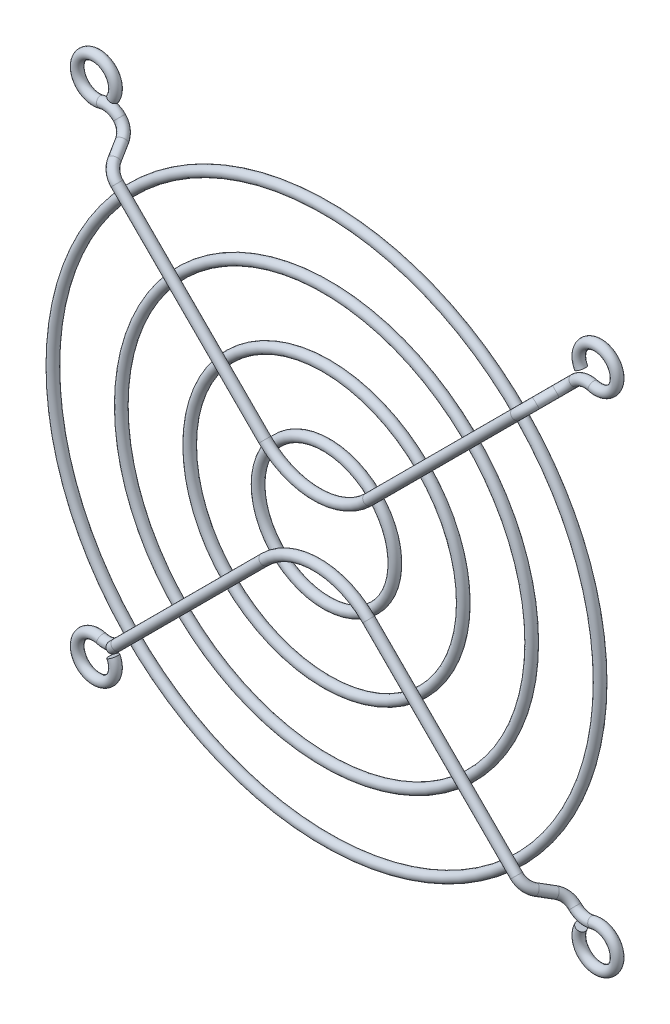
ISO-10303-21;
HEADER;
FILE_DESCRIPTION(('STEP AP214'),'2;1');
FILE_NAME('part.step','',(''),(''),'','','');
FILE_SCHEMA(('AUTOMOTIVE_DESIGN { 1 0 10303 214 1 1 1 1 }'));
ENDSEC;
DATA;
#1=APPLICATION_CONTEXT('core data for automotive mechanical design processes');
#2=APPLICATION_PROTOCOL_DEFINITION('international standard','automotive_design',2000,#1);
#3=PRODUCT_CONTEXT('',#1,'mechanical');
#4=PRODUCT('Part','Part','',(#3));
#5=PRODUCT_RELATED_PRODUCT_CATEGORY('part','',(#4));
#6=PRODUCT_DEFINITION_FORMATION('','',#4);
#7=PRODUCT_DEFINITION_CONTEXT('part definition',#1,'design');
#8=PRODUCT_DEFINITION('design','',#6,#7);
#9=PRODUCT_DEFINITION_SHAPE('','',#8);
#10=(LENGTH_UNIT() NAMED_UNIT(*) SI_UNIT(.MILLI.,.METRE.));
#11=(NAMED_UNIT(*) PLANE_ANGLE_UNIT() SI_UNIT($,.RADIAN.));
#12=(NAMED_UNIT(*) SI_UNIT($,.STERADIAN.) SOLID_ANGLE_UNIT());
#13=UNCERTAINTY_MEASURE_WITH_UNIT(LENGTH_MEASURE(1.E-05),#10,'distance_accuracy_value','');
#14=(GEOMETRIC_REPRESENTATION_CONTEXT(3) GLOBAL_UNCERTAINTY_ASSIGNED_CONTEXT((#13)) GLOBAL_UNIT_ASSIGNED_CONTEXT((#10,
#11,#12)) REPRESENTATION_CONTEXT('',''));
#15=CARTESIAN_POINT('',(0.,0.,0.));
#16=DIRECTION('',(0.,0.,1.));
#17=DIRECTION('',(1.,0.,0.));
#18=AXIS2_PLACEMENT_3D('',#15,#16,#17);
#19=CARTESIAN_POINT('',(0.,0.,3.4));
#20=DIRECTION('',(0.,0.,-1.));
#21=DIRECTION('',(-1.,0.,0.));
#22=AXIS2_PLACEMENT_3D('',#19,#20,#21);
#23=TOROIDAL_SURFACE('',#22,11.25,0.800000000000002);
#24=CARTESIAN_POINT('',(-12.05,0.,3.4));
#25=VERTEX_POINT('',#24);
#26=VERTEX_LOOP('',#25);
#27=FACE_BOUND('',#26,.T.);
#28=ADVANCED_FACE('F37',(#27),#23,.T.);
#29=CLOSED_SHELL('',(#28));
#30=MANIFOLD_SOLID_BREP('B2',#29);
#31=CARTESIAN_POINT('',(0.,0.,3.4));
#32=DIRECTION('',(0.,0.,-1.));
#33=DIRECTION('',(-1.,0.,0.));
#34=AXIS2_PLACEMENT_3D('',#31,#32,#33);
#35=TOROIDAL_SURFACE('',#34,33.75,0.800000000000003);
#36=CARTESIAN_POINT('',(-34.55,0.,3.4));
#37=VERTEX_POINT('',#36);
#38=VERTEX_LOOP('',#37);
#39=FACE_BOUND('',#38,.T.);
#40=ADVANCED_FACE('F55',(#39),#35,.T.);
#41=CLOSED_SHELL('',(#40));
#42=MANIFOLD_SOLID_BREP('B6',#41);
#43=CARTESIAN_POINT('',(0.,0.,3.4));
#44=DIRECTION('',(0.,0.,-1.));
#45=DIRECTION('',(-1.,0.,0.));
#46=AXIS2_PLACEMENT_3D('',#43,#44,#45);
#47=TOROIDAL_SURFACE('',#46,22.5,0.800000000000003);
#48=CARTESIAN_POINT('',(-23.3,0.,3.4));
#49=VERTEX_POINT('',#48);
#50=VERTEX_LOOP('',#49);
#51=FACE_BOUND('',#50,.T.);
#52=ADVANCED_FACE('F73',(#51),#47,.T.);
#53=CLOSED_SHELL('',(#52));
#54=MANIFOLD_SOLID_BREP('B33',#53);
#55=CARTESIAN_POINT('',(0.,0.,3.4));
#56=DIRECTION('',(0.,0.,-1.));
#57=DIRECTION('',(-1.,0.,0.));
#58=AXIS2_PLACEMENT_3D('',#55,#56,#57);
#59=TOROIDAL_SURFACE('',#58,45.,0.800000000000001);
#60=CARTESIAN_POINT('',(-45.8,0.,3.4));
#61=VERTEX_POINT('',#60);
#62=VERTEX_LOOP('',#61);
#63=FACE_BOUND('',#62,.T.);
#64=ADVANCED_FACE('F93',(#63),#59,.T.);
#65=CLOSED_SHELL('',(#64));
#66=MANIFOLD_SOLID_BREP('B51',#65);
#67=CARTESIAN_POINT('',(-41.2499999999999,-41.25,0.));
#68=DIRECTION('',(0.,0.,-1.));
#69=DIRECTION('',(-1.,0.,0.));
#70=AXIS2_PLACEMENT_3D('',#67,#68,#69);
#71=TOROIDAL_SURFACE('',#70,3.14999999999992,0.8);
#72=CARTESIAN_POINT('',(-38.4791267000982,-39.7517472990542,0.));
#73=DIRECTION('',(-0.475635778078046,0.879642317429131,0.));
#74=DIRECTION('',(0.,0.,-1.));
#75=AXIS2_PLACEMENT_3D('',#72,#73,#74);
#76=CIRCLE('',#75,0.8);
#77=CARTESIAN_POINT('',(-37.7754128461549,-39.3712386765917,0.));
#78=VERTEX_POINT('',#77);
#79=EDGE_CURVE('E92',#78,#78,#76,.T.);
#80=CARTESIAN_POINT('',(-40.392127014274,-38.2190671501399,0.));
#81=DIRECTION('',(-0.962200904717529,0.272340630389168,0.));
#82=DIRECTION('',(0.,0.,-1.));
#83=AXIS2_PLACEMENT_3D('',#80,#81,#82);
#84=CIRCLE('',#83,0.8);
#85=CARTESIAN_POINT('',(-40.1742545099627,-37.4493064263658,0.));
#86=VERTEX_POINT('',#85);
#87=EDGE_CURVE('E118',#86,#86,#84,.T.);
#88=CARTESIAN_POINT('',(-41.2499999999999,-41.25,0.));
#89=DIRECTION('',(0.,0.,-1.));
#90=DIRECTION('',(-1.,0.,0.));
#91=AXIS2_PLACEMENT_3D('',#88,#89,#90);
#92=CIRCLE('',#91,3.94999999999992);
#93=EDGE_CURVE('',#78,#86,#92,.T.);
#94=ORIENTED_EDGE('',*,*,#79,.F.);
#95=ORIENTED_EDGE('',*,*,#87,.T.);
#96=ORIENTED_EDGE('',*,*,#93,.T.);
#97=ORIENTED_EDGE('',*,*,#93,.F.);
#98=EDGE_LOOP('',(#94,#96,#95,#97));
#99=FACE_BOUND('',#98,.T.);
#100=ADVANCED_FACE('F112',(#99),#71,.T.);
#101=CARTESIAN_POINT('',(-39.5751051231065,-35.3324644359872,0.));
#102=DIRECTION('',(0.,0.,1.));
#103=DIRECTION('',(1.,0.,0.));
#104=AXIS2_PLACEMENT_3D('',#101,#102,#103);
#105=TOROIDAL_SURFACE('',#104,3.00000000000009,0.8);
#106=CARTESIAN_POINT('',(-37.4537847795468,-37.4537847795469,0.));
#107=DIRECTION('',(-0.707106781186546,-0.707106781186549,0.));
#108=DIRECTION('',(0.,0.,-1.));
#109=AXIS2_PLACEMENT_3D('',#106,#107,#108);
#110=CIRCLE('',#109,0.8);
#111=CARTESIAN_POINT('',(-37.4537847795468,-37.4537847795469,-0.800000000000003));
#112=VERTEX_POINT('',#111);
#113=EDGE_CURVE('E122',#112,#112,#110,.T.);
#114=ORIENTED_EDGE('',*,*,#113,.T.);
#115=EDGE_LOOP('',(#114));
#116=FACE_BOUND('',#115,.T.);
#117=ORIENTED_EDGE('',*,*,#87,.F.);
#118=EDGE_LOOP('',(#117));
#119=FACE_BOUND('',#118,.T.);
#120=ADVANCED_FACE('F207',(#116,#119),#105,.T.);
#121=CARTESIAN_POINT('',(-37.4537847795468,-37.4537847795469,3.));
#122=DIRECTION('',(0.707106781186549,-0.707106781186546,0.));
#123=DIRECTION('',(-0.707106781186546,-0.707106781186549,0.));
#124=AXIS2_PLACEMENT_3D('',#121,#122,#123);
#125=TOROIDAL_SURFACE('',#124,3.,0.8);
#126=CARTESIAN_POINT('',(-35.6722390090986,-35.6722390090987,1.37144563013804));
#127=DIRECTION('',(-0.383853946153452,-0.383853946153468,-0.839828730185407));
#128=DIRECTION('',(0.593848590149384,0.593848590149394,-0.542851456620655));
#129=AXIS2_PLACEMENT_3D('',#126,#127,#128);
#130=CIRCLE('',#129,0.8);
#131=CARTESIAN_POINT('',(-35.1971601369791,-35.1971601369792,0.937164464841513));
#132=VERTEX_POINT('',#131);
#133=EDGE_CURVE('E126',#132,#132,#130,.T.);
#134=CARTESIAN_POINT('',(-37.4537847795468,-37.4537847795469,3.));
#135=DIRECTION('',(0.707106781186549,-0.707106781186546,0.));
#136=DIRECTION('',(-0.707106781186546,-0.707106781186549,0.));
#137=AXIS2_PLACEMENT_3D('',#134,#135,#136);
#138=CIRCLE('',#137,3.8);
#139=EDGE_CURVE('',#112,#132,#138,.T.);
#140=ORIENTED_EDGE('',*,*,#113,.F.);
#141=ORIENTED_EDGE('',*,*,#133,.T.);
#142=ORIENTED_EDGE('',*,*,#139,.T.);
#143=ORIENTED_EDGE('',*,*,#139,.F.);
#144=EDGE_LOOP('',(#140,#142,#141,#143));
#145=FACE_BOUND('',#144,.T.);
#146=ADVANCED_FACE('F211',(#145),#125,.T.);
#147=CARTESIAN_POINT('',(-34.6405999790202,-34.6405999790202,3.62855436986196));
#148=DIRECTION('',(-0.383853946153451,-0.383853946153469,-0.839828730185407));
#149=DIRECTION('',(0.,-0.909502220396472,0.415699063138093));
#150=AXIS2_PLACEMENT_3D('',#147,#148,#149);
#151=CYLINDRICAL_SURFACE('',#150,0.8);
#152=CARTESIAN_POINT('',(-34.6405999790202,-34.6405999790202,3.62855436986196));
#153=DIRECTION('',(-0.383853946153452,-0.383853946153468,-0.839828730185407));
#154=DIRECTION('',(0.593848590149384,0.593848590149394,-0.542851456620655));
#155=AXIS2_PLACEMENT_3D('',#152,#153,#154);
#156=CIRCLE('',#155,0.8);
#157=CARTESIAN_POINT('',(-35.1156788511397,-35.1156788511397,4.06283553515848));
#158=VERTEX_POINT('',#157);
#159=EDGE_CURVE('E131',#158,#158,#156,.T.);
#160=ORIENTED_EDGE('',*,*,#159,.T.);
#161=EDGE_LOOP('',(#160));
#162=FACE_BOUND('',#161,.T.);
#163=ORIENTED_EDGE('',*,*,#133,.F.);
#164=EDGE_LOOP('',(#163));
#165=FACE_BOUND('',#164,.T.);
#166=ADVANCED_FACE('F217',(#162,#165),#151,.T.);
#167=CARTESIAN_POINT('',(-32.859054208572,-32.8590542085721,2.));
#168=DIRECTION('',(-0.707106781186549,0.707106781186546,0.));
#169=DIRECTION('',(0.707106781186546,0.707106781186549,0.));
#170=AXIS2_PLACEMENT_3D('',#167,#168,#169);
#171=TOROIDAL_SURFACE('',#170,3.,0.8);
#172=CARTESIAN_POINT('',(-32.859054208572,-32.8590542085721,5.));
#173=DIRECTION('',(-0.707106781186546,-0.707106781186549,0.));
#174=DIRECTION('',(0.,0.,-1.));
#175=AXIS2_PLACEMENT_3D('',#172,#173,#174);
#176=CIRCLE('',#175,0.8);
#177=CARTESIAN_POINT('',(-32.859054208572,-32.859054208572,5.8));
#178=VERTEX_POINT('',#177);
#179=EDGE_CURVE('E134',#178,#178,#176,.T.);
#180=CARTESIAN_POINT('',(-32.859054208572,-32.8590542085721,2.));
#181=DIRECTION('',(-0.707106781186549,0.707106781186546,0.));
#182=DIRECTION('',(0.707106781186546,0.707106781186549,0.));
#183=AXIS2_PLACEMENT_3D('',#180,#181,#182);
#184=CIRCLE('',#183,3.8);
#185=EDGE_CURVE('',#158,#178,#184,.T.);
#186=ORIENTED_EDGE('',*,*,#159,.F.);
#187=ORIENTED_EDGE('',*,*,#179,.T.);
#188=ORIENTED_EDGE('',*,*,#185,.T.);
#189=ORIENTED_EDGE('',*,*,#185,.F.);
#190=EDGE_LOOP('',(#186,#188,#187,#189));
#191=FACE_BOUND('',#190,.T.);
#192=ADVANCED_FACE('F224',(#191),#171,.T.);
#193=CARTESIAN_POINT('',(-8.5355339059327,-8.53553390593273,5.));
#194=DIRECTION('',(-0.707106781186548,-0.707106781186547,0.));
#195=DIRECTION('',(-0.707106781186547,0.707106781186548,0.));
#196=AXIS2_PLACEMENT_3D('',#193,#194,#195);
#197=CYLINDRICAL_SURFACE('',#196,0.8);
#198=CARTESIAN_POINT('',(-8.5355339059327,-8.53553390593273,5.));
#199=DIRECTION('',(-0.707106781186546,-0.707106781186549,0.));
#200=DIRECTION('',(0.,0.,-1.));
#201=AXIS2_PLACEMENT_3D('',#198,#199,#200);
#202=CIRCLE('',#201,0.8);
#203=CARTESIAN_POINT('',(-9.10121933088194,-7.96984848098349,5.));
#204=VERTEX_POINT('',#203);
#205=EDGE_CURVE('E137',#204,#204,#202,.T.);
#206=ORIENTED_EDGE('',*,*,#205,.T.);
#207=EDGE_LOOP('',(#206));
#208=FACE_BOUND('',#207,.T.);
#209=ORIENTED_EDGE('',*,*,#179,.F.);
#210=EDGE_LOOP('',(#209));
#211=FACE_BOUND('',#210,.T.);
#212=ADVANCED_FACE('F228',(#208,#211),#197,.T.);
#213=CARTESIAN_POINT('',(0.,-17.0710678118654,5.));
#214=DIRECTION('',(0.,0.,1.));
#215=DIRECTION('',(1.,0.,0.));
#216=AXIS2_PLACEMENT_3D('',#213,#214,#215);
#217=TOROIDAL_SURFACE('',#216,12.0710678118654,0.8);
#218=CARTESIAN_POINT('',(8.5355339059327,-8.53553390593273,5.));
#219=DIRECTION('',(-0.707106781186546,0.707106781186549,0.));
#220=DIRECTION('',(0.,0.,-1.));
#221=AXIS2_PLACEMENT_3D('',#218,#219,#220);
#222=CIRCLE('',#221,0.8);
#223=CARTESIAN_POINT('',(9.10121933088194,-7.96984848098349,5.));
#224=VERTEX_POINT('',#223);
#225=EDGE_CURVE('E158',#224,#224,#222,.T.);
#226=CARTESIAN_POINT('',(0.,-17.0710678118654,5.));
#227=DIRECTION('',(0.,0.,1.));
#228=DIRECTION('',(1.,0.,0.));
#229=AXIS2_PLACEMENT_3D('',#226,#227,#228);
#230=CIRCLE('',#229,12.8710678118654);
#231=EDGE_CURVE('',#224,#204,#230,.T.);
#232=ORIENTED_EDGE('',*,*,#225,.T.);
#233=ORIENTED_EDGE('',*,*,#205,.F.);
#234=ORIENTED_EDGE('',*,*,#231,.T.);
#235=ORIENTED_EDGE('',*,*,#231,.F.);
#236=EDGE_LOOP('',(#232,#234,#233,#235));
#237=FACE_BOUND('',#236,.T.);
#238=ADVANCED_FACE('F162',(#237),#217,.T.);
#239=CARTESIAN_POINT('',(-38.4791267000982,-39.7517472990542,0.));
#240=DIRECTION('',(0.475635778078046,-0.879642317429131,0.));
#241=DIRECTION('',(0.,0.,-1.));
#242=AXIS2_PLACEMENT_3D('',#239,#240,#241);
#243=PLANE('',#242);
#244=ORIENTED_EDGE('',*,*,#79,.T.);
#245=EDGE_LOOP('',(#244));
#246=FACE_BOUND('',#245,.T.);
#247=ADVANCED_FACE('F198',(#246),#243,.F.);
#248=CARTESIAN_POINT('',(41.2499999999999,-41.25,0.));
#249=DIRECTION('',(0.,0.,1.));
#250=DIRECTION('',(1.,0.,0.));
#251=AXIS2_PLACEMENT_3D('',#248,#249,#250);
#252=TOROIDAL_SURFACE('',#251,3.14999999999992,0.8);
#253=CARTESIAN_POINT('',(38.4791267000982,-39.7517472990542,0.));
#254=DIRECTION('',(-0.475635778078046,-0.879642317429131,0.));
#255=DIRECTION('',(0.,0.,-1.));
#256=AXIS2_PLACEMENT_3D('',#253,#254,#255);
#257=CIRCLE('',#256,0.8);
#258=CARTESIAN_POINT('',(37.7754128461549,-39.3712386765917,0.));
#259=VERTEX_POINT('',#258);
#260=EDGE_CURVE('E140',#259,#259,#257,.T.);
#261=CARTESIAN_POINT('',(40.392127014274,-38.2190671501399,0.));
#262=DIRECTION('',(-0.962200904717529,-0.272340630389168,0.));
#263=DIRECTION('',(0.,0.,-1.));
#264=AXIS2_PLACEMENT_3D('',#261,#262,#263);
#265=CIRCLE('',#264,0.8);
#266=CARTESIAN_POINT('',(40.1742545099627,-37.4493064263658,0.));
#267=VERTEX_POINT('',#266);
#268=EDGE_CURVE('E143',#267,#267,#265,.T.);
#269=CARTESIAN_POINT('',(41.2499999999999,-41.25,0.));
#270=DIRECTION('',(0.,0.,1.));
#271=DIRECTION('',(1.,0.,0.));
#272=AXIS2_PLACEMENT_3D('',#269,#270,#271);
#273=CIRCLE('',#272,3.94999999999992);
#274=EDGE_CURVE('',#259,#267,#273,.T.);
#275=ORIENTED_EDGE('',*,*,#260,.T.);
#276=ORIENTED_EDGE('',*,*,#268,.F.);
#277=ORIENTED_EDGE('',*,*,#274,.T.);
#278=ORIENTED_EDGE('',*,*,#274,.F.);
#279=EDGE_LOOP('',(#275,#277,#276,#278));
#280=FACE_BOUND('',#279,.T.);
#281=ADVANCED_FACE('F192',(#280),#252,.T.);
#282=CARTESIAN_POINT('',(39.5751051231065,-35.3324644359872,0.));
#283=DIRECTION('',(0.,0.,-1.));
#284=DIRECTION('',(-1.,0.,0.));
#285=AXIS2_PLACEMENT_3D('',#282,#283,#284);
#286=TOROIDAL_SURFACE('',#285,3.00000000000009,0.8);
#287=CARTESIAN_POINT('',(37.4537847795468,-37.4537847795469,0.));
#288=DIRECTION('',(-0.707106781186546,0.707106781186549,0.));
#289=DIRECTION('',(0.,0.,-1.));
#290=AXIS2_PLACEMENT_3D('',#287,#288,#289);
#291=CIRCLE('',#290,0.8);
#292=CARTESIAN_POINT('',(37.4537847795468,-37.4537847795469,-0.800000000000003));
#293=VERTEX_POINT('',#292);
#294=EDGE_CURVE('E146',#293,#293,#291,.T.);
#295=ORIENTED_EDGE('',*,*,#294,.F.);
#296=EDGE_LOOP('',(#295));
#297=FACE_BOUND('',#296,.T.);
#298=ORIENTED_EDGE('',*,*,#268,.T.);
#299=EDGE_LOOP('',(#298));
#300=FACE_BOUND('',#299,.T.);
#301=ADVANCED_FACE('F186',(#297,#300),#286,.T.);
#302=CARTESIAN_POINT('',(37.4537847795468,-37.4537847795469,3.));
#303=DIRECTION('',(0.707106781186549,0.707106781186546,0.));
#304=DIRECTION('',(0.707106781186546,-0.707106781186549,0.));
#305=AXIS2_PLACEMENT_3D('',#302,#303,#304);
#306=TOROIDAL_SURFACE('',#305,3.,0.8);
#307=CARTESIAN_POINT('',(35.6722390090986,-35.6722390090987,1.37144563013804));
#308=DIRECTION('',(-0.383853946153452,0.383853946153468,0.839828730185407));
#309=DIRECTION('',(-0.593848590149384,0.593848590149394,-0.542851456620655));
#310=AXIS2_PLACEMENT_3D('',#307,#308,#309);
#311=CIRCLE('',#310,0.8);
#312=CARTESIAN_POINT('',(35.1971601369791,-35.1971601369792,0.937164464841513));
#313=VERTEX_POINT('',#312);
#314=EDGE_CURVE('E149',#313,#313,#311,.T.);
#315=CARTESIAN_POINT('',(37.4537847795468,-37.4537847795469,3.));
#316=DIRECTION('',(0.707106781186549,0.707106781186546,0.));
#317=DIRECTION('',(0.707106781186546,-0.707106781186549,0.));
#318=AXIS2_PLACEMENT_3D('',#315,#316,#317);
#319=CIRCLE('',#318,3.8);
#320=EDGE_CURVE('',#293,#313,#319,.T.);
#321=ORIENTED_EDGE('',*,*,#294,.T.);
#322=ORIENTED_EDGE('',*,*,#314,.F.);
#323=ORIENTED_EDGE('',*,*,#320,.T.);
#324=ORIENTED_EDGE('',*,*,#320,.F.);
#325=EDGE_LOOP('',(#321,#323,#322,#324));
#326=FACE_BOUND('',#325,.T.);
#327=ADVANCED_FACE('F180',(#326),#306,.T.);
#328=CARTESIAN_POINT('',(34.6405999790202,-34.6405999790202,3.62855436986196));
#329=DIRECTION('',(0.383853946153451,-0.383853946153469,-0.839828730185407));
#330=DIRECTION('',(0.,-0.909502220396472,0.415699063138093));
#331=AXIS2_PLACEMENT_3D('',#328,#329,#330);
#332=CYLINDRICAL_SURFACE('',#331,0.8);
#333=CARTESIAN_POINT('',(34.6405999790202,-34.6405999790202,3.62855436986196));
#334=DIRECTION('',(-0.383853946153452,0.383853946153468,0.839828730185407));
#335=DIRECTION('',(-0.593848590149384,0.593848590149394,-0.542851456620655));
#336=AXIS2_PLACEMENT_3D('',#333,#334,#335);
#337=CIRCLE('',#336,0.8);
#338=CARTESIAN_POINT('',(35.1156788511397,-35.1156788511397,4.06283553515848));
#339=VERTEX_POINT('',#338);
#340=EDGE_CURVE('E152',#339,#339,#337,.T.);
#341=ORIENTED_EDGE('',*,*,#340,.F.);
#342=EDGE_LOOP('',(#341));
#343=FACE_BOUND('',#342,.T.);
#344=ORIENTED_EDGE('',*,*,#314,.T.);
#345=EDGE_LOOP('',(#344));
#346=FACE_BOUND('',#345,.T.);
#347=ADVANCED_FACE('F174',(#343,#346),#332,.T.);
#348=CARTESIAN_POINT('',(32.859054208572,-32.8590542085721,2.));
#349=DIRECTION('',(-0.707106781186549,-0.707106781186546,0.));
#350=DIRECTION('',(-0.707106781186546,0.707106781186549,0.));
#351=AXIS2_PLACEMENT_3D('',#348,#349,#350);
#352=TOROIDAL_SURFACE('',#351,3.,0.8);
#353=CARTESIAN_POINT('',(32.859054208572,-32.8590542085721,5.));
#354=DIRECTION('',(-0.707106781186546,0.707106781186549,0.));
#355=DIRECTION('',(0.,0.,-1.));
#356=AXIS2_PLACEMENT_3D('',#353,#354,#355);
#357=CIRCLE('',#356,0.8);
#358=CARTESIAN_POINT('',(32.859054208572,-32.859054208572,5.8));
#359=VERTEX_POINT('',#358);
#360=EDGE_CURVE('E155',#359,#359,#357,.T.);
#361=CARTESIAN_POINT('',(32.859054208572,-32.8590542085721,2.));
#362=DIRECTION('',(-0.707106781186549,-0.707106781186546,0.));
#363=DIRECTION('',(-0.707106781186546,0.707106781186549,0.));
#364=AXIS2_PLACEMENT_3D('',#361,#362,#363);
#365=CIRCLE('',#364,3.8);
#366=EDGE_CURVE('',#339,#359,#365,.T.);
#367=ORIENTED_EDGE('',*,*,#340,.T.);
#368=ORIENTED_EDGE('',*,*,#360,.F.);
#369=ORIENTED_EDGE('',*,*,#366,.T.);
#370=ORIENTED_EDGE('',*,*,#366,.F.);
#371=EDGE_LOOP('',(#367,#369,#368,#370));
#372=FACE_BOUND('',#371,.T.);
#373=ADVANCED_FACE('F168',(#372),#352,.T.);
#374=CARTESIAN_POINT('',(8.5355339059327,-8.53553390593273,5.));
#375=DIRECTION('',(0.707106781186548,-0.707106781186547,0.));
#376=DIRECTION('',(-0.707106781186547,-0.707106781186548,0.));
#377=AXIS2_PLACEMENT_3D('',#374,#375,#376);
#378=CYLINDRICAL_SURFACE('',#377,0.8);
#379=ORIENTED_EDGE('',*,*,#225,.F.);
#380=EDGE_LOOP('',(#379));
#381=FACE_BOUND('',#380,.T.);
#382=ORIENTED_EDGE('',*,*,#360,.T.);
#383=EDGE_LOOP('',(#382));
#384=FACE_BOUND('',#383,.T.);
#385=ADVANCED_FACE('F164',(#381,#384),#378,.T.);
#386=CARTESIAN_POINT('',(38.4791267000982,-39.7517472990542,0.));
#387=DIRECTION('',(-0.475635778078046,-0.879642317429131,0.));
#388=DIRECTION('',(0.,0.,-1.));
#389=AXIS2_PLACEMENT_3D('',#386,#387,#388);
#390=PLANE('',#389);
#391=ORIENTED_EDGE('',*,*,#260,.F.);
#392=EDGE_LOOP('',(#391));
#393=FACE_BOUND('',#392,.T.);
#394=ADVANCED_FACE('F167',(#393),#390,.F.);
#395=CLOSED_SHELL('',(#100,#120,#146,#166,#192,#212,#238,#247,#281,#301,#327,#347,#373,#385,#394));
#396=MANIFOLD_SOLID_BREP('B69',#395);
#397=CARTESIAN_POINT('',(-41.2499999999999,41.25,0.));
#398=DIRECTION('',(0.,0.,-1.));
#399=DIRECTION('',(-1.,0.,0.));
#400=AXIS2_PLACEMENT_3D('',#397,#398,#399);
#401=TOROIDAL_SURFACE('',#400,3.14999999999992,0.8);
#402=CARTESIAN_POINT('',(-40.392127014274,38.2190671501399,0.));
#403=DIRECTION('',(0.962200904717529,0.272340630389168,0.));
#404=DIRECTION('',(0.,0.,-1.));
#405=AXIS2_PLACEMENT_3D('',#402,#403,#404);
#406=CIRCLE('',#405,0.8);
#407=CARTESIAN_POINT('',(-40.1742545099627,37.4493064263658,0.));
#408=VERTEX_POINT('',#407);
#409=EDGE_CURVE('E341',#408,#408,#406,.T.);
#410=CARTESIAN_POINT('',(-38.4791267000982,39.7517472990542,0.));
#411=DIRECTION('',(0.475635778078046,0.879642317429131,0.));
#412=DIRECTION('',(0.,0.,-1.));
#413=AXIS2_PLACEMENT_3D('',#410,#411,#412);
#414=CIRCLE('',#413,0.8);
#415=CARTESIAN_POINT('',(-37.7754128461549,39.3712386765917,0.));
#416=VERTEX_POINT('',#415);
#417=EDGE_CURVE('E111',#416,#416,#414,.T.);
#418=CARTESIAN_POINT('',(-41.2499999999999,41.25,0.));
#419=DIRECTION('',(0.,0.,-1.));
#420=DIRECTION('',(-1.,0.,0.));
#421=AXIS2_PLACEMENT_3D('',#418,#419,#420);
#422=CIRCLE('',#421,3.94999999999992);
#423=EDGE_CURVE('',#408,#416,#422,.T.);
#424=ORIENTED_EDGE('',*,*,#409,.F.);
#425=ORIENTED_EDGE('',*,*,#417,.T.);
#426=ORIENTED_EDGE('',*,*,#423,.T.);
#427=ORIENTED_EDGE('',*,*,#423,.F.);
#428=EDGE_LOOP('',(#424,#426,#425,#427));
#429=FACE_BOUND('',#428,.T.);
#430=ADVANCED_FACE('F335',(#429),#401,.T.);
#431=CARTESIAN_POINT('',(-39.5751051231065,35.3324644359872,0.));
#432=DIRECTION('',(0.,0.,1.));
#433=DIRECTION('',(1.,0.,0.));
#434=AXIS2_PLACEMENT_3D('',#431,#432,#433);
#435=TOROIDAL_SURFACE('',#434,3.00000000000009,0.8);
#436=CARTESIAN_POINT('',(-37.4537847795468,37.4537847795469,0.));
#437=DIRECTION('',(0.707106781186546,-0.707106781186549,0.));
#438=DIRECTION('',(0.,0.,-1.));
#439=AXIS2_PLACEMENT_3D('',#436,#437,#438);
#440=CIRCLE('',#439,0.8);
#441=CARTESIAN_POINT('',(-37.4537847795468,37.4537847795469,-0.800000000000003));
#442=VERTEX_POINT('',#441);
#443=EDGE_CURVE('E345',#442,#442,#440,.T.);
#444=ORIENTED_EDGE('',*,*,#443,.F.);
#445=EDGE_LOOP('',(#444));
#446=FACE_BOUND('',#445,.T.);
#447=ORIENTED_EDGE('',*,*,#409,.T.);
#448=EDGE_LOOP('',(#447));
#449=FACE_BOUND('',#448,.T.);
#450=ADVANCED_FACE('F405',(#446,#449),#435,.T.);
#451=CARTESIAN_POINT('',(-37.4537847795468,37.4537847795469,3.));
#452=DIRECTION('',(0.707106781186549,0.707106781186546,0.));
#453=DIRECTION('',(-0.707106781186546,0.707106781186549,0.));
#454=AXIS2_PLACEMENT_3D('',#451,#452,#453);
#455=TOROIDAL_SURFACE('',#454,3.,0.8);
#456=CARTESIAN_POINT('',(-35.6722390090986,35.6722390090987,1.37144563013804));
#457=DIRECTION('',(0.383853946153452,-0.383853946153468,0.839828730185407));
#458=DIRECTION('',(0.593848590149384,-0.593848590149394,-0.542851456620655));
#459=AXIS2_PLACEMENT_3D('',#456,#457,#458);
#460=CIRCLE('',#459,0.8);
#461=CARTESIAN_POINT('',(-35.1971601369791,35.1971601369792,0.937164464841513));
#462=VERTEX_POINT('',#461);
#463=EDGE_CURVE('E349',#462,#462,#460,.T.);
#464=CARTESIAN_POINT('',(-37.4537847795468,37.4537847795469,3.));
#465=DIRECTION('',(0.707106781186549,0.707106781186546,0.));
#466=DIRECTION('',(-0.707106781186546,0.707106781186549,0.));
#467=AXIS2_PLACEMENT_3D('',#464,#465,#466);
#468=CIRCLE('',#467,3.8);
#469=EDGE_CURVE('',#462,#442,#468,.T.);
#470=ORIENTED_EDGE('',*,*,#463,.F.);
#471=ORIENTED_EDGE('',*,*,#443,.T.);
#472=ORIENTED_EDGE('',*,*,#469,.T.);
#473=ORIENTED_EDGE('',*,*,#469,.F.);
#474=EDGE_LOOP('',(#470,#472,#471,#473));
#475=FACE_BOUND('',#474,.T.);
#476=ADVANCED_FACE('F410',(#475),#455,.T.);
#477=CARTESIAN_POINT('',(-34.6405999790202,34.6405999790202,3.62855436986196));
#478=DIRECTION('',(-0.383853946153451,0.383853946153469,-0.839828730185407));
#479=DIRECTION('',(0.,0.909502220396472,0.415699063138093));
#480=AXIS2_PLACEMENT_3D('',#477,#478,#479);
#481=CYLINDRICAL_SURFACE('',#480,0.8);
#482=CARTESIAN_POINT('',(-34.6405999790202,34.6405999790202,3.62855436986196));
#483=DIRECTION('',(0.383853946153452,-0.383853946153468,0.839828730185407));
#484=DIRECTION('',(0.593848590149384,-0.593848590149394,-0.542851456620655));
#485=AXIS2_PLACEMENT_3D('',#482,#483,#484);
#486=CIRCLE('',#485,0.8);
#487=CARTESIAN_POINT('',(-35.1156788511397,35.1156788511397,4.06283553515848));
#488=VERTEX_POINT('',#487);
#489=EDGE_CURVE('E354',#488,#488,#486,.T.);
#490=ORIENTED_EDGE('',*,*,#489,.F.);
#491=EDGE_LOOP('',(#490));
#492=FACE_BOUND('',#491,.T.);
#493=ORIENTED_EDGE('',*,*,#463,.T.);
#494=EDGE_LOOP('',(#493));
#495=FACE_BOUND('',#494,.T.);
#496=ADVANCED_FACE('F415',(#492,#495),#481,.T.);
#497=CARTESIAN_POINT('',(-32.859054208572,32.8590542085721,2.));
#498=DIRECTION('',(-0.707106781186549,-0.707106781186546,0.));
#499=DIRECTION('',(0.707106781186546,-0.707106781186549,0.));
#500=AXIS2_PLACEMENT_3D('',#497,#498,#499);
#501=TOROIDAL_SURFACE('',#500,3.,0.8);
#502=CARTESIAN_POINT('',(-32.859054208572,32.8590542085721,5.));
#503=DIRECTION('',(0.707106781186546,-0.707106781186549,0.));
#504=DIRECTION('',(0.,0.,-1.));
#505=AXIS2_PLACEMENT_3D('',#502,#503,#504);
#506=CIRCLE('',#505,0.8);
#507=CARTESIAN_POINT('',(-32.859054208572,32.859054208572,5.8));
#508=VERTEX_POINT('',#507);
#509=EDGE_CURVE('E357',#508,#508,#506,.T.);
#510=CARTESIAN_POINT('',(-32.859054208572,32.8590542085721,2.));
#511=DIRECTION('',(-0.707106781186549,-0.707106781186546,0.));
#512=DIRECTION('',(0.707106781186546,-0.707106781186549,0.));
#513=AXIS2_PLACEMENT_3D('',#510,#511,#512);
#514=CIRCLE('',#513,3.8);
#515=EDGE_CURVE('',#508,#488,#514,.T.);
#516=ORIENTED_EDGE('',*,*,#509,.F.);
#517=ORIENTED_EDGE('',*,*,#489,.T.);
#518=ORIENTED_EDGE('',*,*,#515,.T.);
#519=ORIENTED_EDGE('',*,*,#515,.F.);
#520=EDGE_LOOP('',(#516,#518,#517,#519));
#521=FACE_BOUND('',#520,.T.);
#522=ADVANCED_FACE('F401',(#521),#501,.T.);
#523=CARTESIAN_POINT('',(-8.5355339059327,8.53553390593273,5.));
#524=DIRECTION('',(-0.707106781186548,0.707106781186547,0.));
#525=DIRECTION('',(-0.707106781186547,-0.707106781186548,0.));
#526=AXIS2_PLACEMENT_3D('',#523,#524,#525);
#527=CYLINDRICAL_SURFACE('',#526,0.8);
#528=CARTESIAN_POINT('',(-8.5355339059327,8.53553390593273,5.));
#529=DIRECTION('',(0.707106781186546,-0.707106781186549,0.));
#530=DIRECTION('',(0.,0.,-1.));
#531=AXIS2_PLACEMENT_3D('',#528,#529,#530);
#532=CIRCLE('',#531,0.8);
#533=CARTESIAN_POINT('',(-9.10121933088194,7.96984848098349,5.));
#534=VERTEX_POINT('',#533);
#535=EDGE_CURVE('E360',#534,#534,#532,.T.);
#536=ORIENTED_EDGE('',*,*,#535,.F.);
#537=EDGE_LOOP('',(#536));
#538=FACE_BOUND('',#537,.T.);
#539=ORIENTED_EDGE('',*,*,#509,.T.);
#540=EDGE_LOOP('',(#539));
#541=FACE_BOUND('',#540,.T.);
#542=ADVANCED_FACE('F391',(#538,#541),#527,.T.);
#543=CARTESIAN_POINT('',(0.,17.0710678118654,5.));
#544=DIRECTION('',(0.,0.,1.));
#545=DIRECTION('',(1.,0.,0.));
#546=AXIS2_PLACEMENT_3D('',#543,#544,#545);
#547=TOROIDAL_SURFACE('',#546,12.0710678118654,0.8);
#548=CARTESIAN_POINT('',(8.5355339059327,8.53553390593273,5.));
#549=DIRECTION('',(0.707106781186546,0.707106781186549,0.));
#550=DIRECTION('',(0.,0.,-1.));
#551=AXIS2_PLACEMENT_3D('',#548,#549,#550);
#552=CIRCLE('',#551,0.8);
#553=CARTESIAN_POINT('',(9.10121933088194,7.96984848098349,5.));
#554=VERTEX_POINT('',#553);
#555=EDGE_CURVE('E381',#554,#554,#552,.T.);
#556=CARTESIAN_POINT('',(0.,17.0710678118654,5.));
#557=DIRECTION('',(0.,0.,1.));
#558=DIRECTION('',(1.,0.,0.));
#559=AXIS2_PLACEMENT_3D('',#556,#557,#558);
#560=CIRCLE('',#559,12.8710678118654);
#561=EDGE_CURVE('',#534,#554,#560,.T.);
#562=ORIENTED_EDGE('',*,*,#535,.T.);
#563=ORIENTED_EDGE('',*,*,#555,.F.);
#564=ORIENTED_EDGE('',*,*,#561,.T.);
#565=ORIENTED_EDGE('',*,*,#561,.F.);
#566=EDGE_LOOP('',(#562,#564,#563,#565));
#567=FACE_BOUND('',#566,.T.);
#568=ADVANCED_FACE('F388',(#567),#547,.T.);
#569=CARTESIAN_POINT('',(-38.4791267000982,39.7517472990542,0.));
#570=DIRECTION('',(0.475635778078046,0.879642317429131,0.));
#571=DIRECTION('',(0.,0.,-1.));
#572=AXIS2_PLACEMENT_3D('',#569,#570,#571);
#573=PLANE('',#572);
#574=ORIENTED_EDGE('',*,*,#417,.F.);
#575=EDGE_LOOP('',(#574));
#576=FACE_BOUND('',#575,.T.);
#577=ADVANCED_FACE('F390',(#576),#573,.F.);
#578=CARTESIAN_POINT('',(41.2499999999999,41.25,0.));
#579=DIRECTION('',(0.,0.,1.));
#580=DIRECTION('',(1.,0.,0.));
#581=AXIS2_PLACEMENT_3D('',#578,#579,#580);
#582=TOROIDAL_SURFACE('',#581,3.14999999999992,0.8);
#583=CARTESIAN_POINT('',(40.392127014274,38.2190671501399,0.));
#584=DIRECTION('',(0.962200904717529,-0.272340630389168,0.));
#585=DIRECTION('',(0.,0.,-1.));
#586=AXIS2_PLACEMENT_3D('',#583,#584,#585);
#587=CIRCLE('',#586,0.8);
#588=CARTESIAN_POINT('',(40.1742545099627,37.4493064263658,0.));
#589=VERTEX_POINT('',#588);
#590=EDGE_CURVE('E366',#589,#589,#587,.T.);
#591=CARTESIAN_POINT('',(38.4791267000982,39.7517472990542,0.));
#592=DIRECTION('',(0.475635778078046,-0.879642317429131,0.));
#593=DIRECTION('',(0.,0.,-1.));
#594=AXIS2_PLACEMENT_3D('',#591,#592,#593);
#595=CIRCLE('',#594,0.8);
#596=CARTESIAN_POINT('',(37.7754128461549,39.3712386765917,0.));
#597=VERTEX_POINT('',#596);
#598=EDGE_CURVE('E363',#597,#597,#595,.T.);
#599=CARTESIAN_POINT('',(41.2499999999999,41.25,0.));
#600=DIRECTION('',(0.,0.,1.));
#601=DIRECTION('',(1.,0.,0.));
#602=AXIS2_PLACEMENT_3D('',#599,#600,#601);
#603=CIRCLE('',#602,3.94999999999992);
#604=EDGE_CURVE('',#589,#597,#603,.T.);
#605=ORIENTED_EDGE('',*,*,#590,.T.);
#606=ORIENTED_EDGE('',*,*,#598,.F.);
#607=ORIENTED_EDGE('',*,*,#604,.T.);
#608=ORIENTED_EDGE('',*,*,#604,.F.);
#609=EDGE_LOOP('',(#605,#607,#606,#608));
#610=FACE_BOUND('',#609,.T.);
#611=ADVANCED_FACE('F398',(#610),#582,.T.);
#612=CARTESIAN_POINT('',(39.5751051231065,35.3324644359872,0.));
#613=DIRECTION('',(0.,0.,-1.));
#614=DIRECTION('',(-1.,0.,0.));
#615=AXIS2_PLACEMENT_3D('',#612,#613,#614);
#616=TOROIDAL_SURFACE('',#615,3.00000000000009,0.8);
#617=CARTESIAN_POINT('',(37.4537847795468,37.4537847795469,0.));
#618=DIRECTION('',(0.707106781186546,0.707106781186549,0.));
#619=DIRECTION('',(0.,0.,-1.));
#620=AXIS2_PLACEMENT_3D('',#617,#618,#619);
#621=CIRCLE('',#620,0.8);
#622=CARTESIAN_POINT('',(37.4537847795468,37.4537847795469,-0.800000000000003));
#623=VERTEX_POINT('',#622);
#624=EDGE_CURVE('E369',#623,#623,#621,.T.);
#625=ORIENTED_EDGE('',*,*,#624,.T.);
#626=EDGE_LOOP('',(#625));
#627=FACE_BOUND('',#626,.T.);
#628=ORIENTED_EDGE('',*,*,#590,.F.);
#629=EDGE_LOOP('',(#628));
#630=FACE_BOUND('',#629,.T.);
#631=ADVANCED_FACE('F460',(#627,#630),#616,.T.);
#632=CARTESIAN_POINT('',(37.4537847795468,37.4537847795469,3.));
#633=DIRECTION('',(0.707106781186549,-0.707106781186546,0.));
#634=DIRECTION('',(0.707106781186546,0.707106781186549,0.));
#635=AXIS2_PLACEMENT_3D('',#632,#633,#634);
#636=TOROIDAL_SURFACE('',#635,3.,0.8);
#637=CARTESIAN_POINT('',(35.6722390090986,35.6722390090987,1.37144563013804));
#638=DIRECTION('',(0.383853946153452,0.383853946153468,-0.839828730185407));
#639=DIRECTION('',(-0.593848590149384,-0.593848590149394,-0.542851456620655));
#640=AXIS2_PLACEMENT_3D('',#637,#638,#639);
#641=CIRCLE('',#640,0.8);
#642=CARTESIAN_POINT('',(35.1971601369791,35.1971601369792,0.937164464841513));
#643=VERTEX_POINT('',#642);
#644=EDGE_CURVE('E372',#643,#643,#641,.T.);
#645=CARTESIAN_POINT('',(37.4537847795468,37.4537847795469,3.));
#646=DIRECTION('',(0.707106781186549,-0.707106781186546,0.));
#647=DIRECTION('',(0.707106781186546,0.707106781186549,0.));
#648=AXIS2_PLACEMENT_3D('',#645,#646,#647);
#649=CIRCLE('',#648,3.8);
#650=EDGE_CURVE('',#643,#623,#649,.T.);
#651=ORIENTED_EDGE('',*,*,#644,.T.);
#652=ORIENTED_EDGE('',*,*,#624,.F.);
#653=ORIENTED_EDGE('',*,*,#650,.T.);
#654=ORIENTED_EDGE('',*,*,#650,.F.);
#655=EDGE_LOOP('',(#651,#653,#652,#654));
#656=FACE_BOUND('',#655,.T.);
#657=ADVANCED_FACE('F470',(#656),#636,.T.);
#658=CARTESIAN_POINT('',(34.6405999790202,34.6405999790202,3.62855436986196));
#659=DIRECTION('',(0.383853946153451,0.383853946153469,-0.839828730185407));
#660=DIRECTION('',(0.,0.909502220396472,0.415699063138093));
#661=AXIS2_PLACEMENT_3D('',#658,#659,#660);
#662=CYLINDRICAL_SURFACE('',#661,0.8);
#663=CARTESIAN_POINT('',(34.6405999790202,34.6405999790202,3.62855436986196));
#664=DIRECTION('',(0.383853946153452,0.383853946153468,-0.839828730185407));
#665=DIRECTION('',(-0.593848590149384,-0.593848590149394,-0.542851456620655));
#666=AXIS2_PLACEMENT_3D('',#663,#664,#665);
#667=CIRCLE('',#666,0.8);
#668=CARTESIAN_POINT('',(35.1156788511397,35.1156788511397,4.06283553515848));
#669=VERTEX_POINT('',#668);
#670=EDGE_CURVE('E375',#669,#669,#667,.T.);
#671=ORIENTED_EDGE('',*,*,#670,.T.);
#672=EDGE_LOOP('',(#671));
#673=FACE_BOUND('',#672,.T.);
#674=ORIENTED_EDGE('',*,*,#644,.F.);
#675=EDGE_LOOP('',(#674));
#676=FACE_BOUND('',#675,.T.);
#677=ADVANCED_FACE('F480',(#673,#676),#662,.T.);
#678=CARTESIAN_POINT('',(32.859054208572,32.8590542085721,2.));
#679=DIRECTION('',(-0.707106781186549,0.707106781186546,0.));
#680=DIRECTION('',(-0.707106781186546,-0.707106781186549,0.));
#681=AXIS2_PLACEMENT_3D('',#678,#679,#680);
#682=TOROIDAL_SURFACE('',#681,3.,0.8);
#683=CARTESIAN_POINT('',(32.859054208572,32.8590542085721,5.));
#684=DIRECTION('',(0.707106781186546,0.707106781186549,0.));
#685=DIRECTION('',(0.,0.,-1.));
#686=AXIS2_PLACEMENT_3D('',#683,#684,#685);
#687=CIRCLE('',#686,0.8);
#688=CARTESIAN_POINT('',(32.859054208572,32.859054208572,5.8));
#689=VERTEX_POINT('',#688);
#690=EDGE_CURVE('E378',#689,#689,#687,.T.);
#691=CARTESIAN_POINT('',(32.859054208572,32.8590542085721,2.));
#692=DIRECTION('',(-0.707106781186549,0.707106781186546,0.));
#693=DIRECTION('',(-0.707106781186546,-0.707106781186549,0.));
#694=AXIS2_PLACEMENT_3D('',#691,#692,#693);
#695=CIRCLE('',#694,3.8);
#696=EDGE_CURVE('',#689,#669,#695,.T.);
#697=ORIENTED_EDGE('',*,*,#690,.T.);
#698=ORIENTED_EDGE('',*,*,#670,.F.);
#699=ORIENTED_EDGE('',*,*,#696,.T.);
#700=ORIENTED_EDGE('',*,*,#696,.F.);
#701=EDGE_LOOP('',(#697,#699,#698,#700));
#702=FACE_BOUND('',#701,.T.);
#703=ADVANCED_FACE('F490',(#702),#682,.T.);
#704=CARTESIAN_POINT('',(8.5355339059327,8.53553390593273,5.));
#705=DIRECTION('',(0.707106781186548,0.707106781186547,0.));
#706=DIRECTION('',(-0.707106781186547,0.707106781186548,0.));
#707=AXIS2_PLACEMENT_3D('',#704,#705,#706);
#708=CYLINDRICAL_SURFACE('',#707,0.8);
#709=ORIENTED_EDGE('',*,*,#555,.T.);
#710=EDGE_LOOP('',(#709));
#711=FACE_BOUND('',#710,.T.);
#712=ORIENTED_EDGE('',*,*,#690,.F.);
#713=EDGE_LOOP('',(#712));
#714=FACE_BOUND('',#713,.T.);
#715=ADVANCED_FACE('F385',(#711,#714),#708,.T.);
#716=CARTESIAN_POINT('',(38.4791267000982,39.7517472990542,0.));
#717=DIRECTION('',(-0.475635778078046,0.879642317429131,0.));
#718=DIRECTION('',(0.,0.,-1.));
#719=AXIS2_PLACEMENT_3D('',#716,#717,#718);
#720=PLANE('',#719);
#721=ORIENTED_EDGE('',*,*,#598,.T.);
#722=EDGE_LOOP('',(#721));
#723=FACE_BOUND('',#722,.T.);
#724=ADVANCED_FACE('F509',(#723),#720,.F.);
#725=CLOSED_SHELL('',(#430,#450,#476,#496,#522,#542,#568,#577,#611,#631,#657,#677,#703,#715,#724));
#726=MANIFOLD_SOLID_BREP('B87',#725);
#727=ADVANCED_BREP_SHAPE_REPRESENTATION('',(#18,#30,#42,#54,#66,#396,#726),#14);
#728=SHAPE_DEFINITION_REPRESENTATION(#9,#727);
ENDSEC;
END-ISO-10303-21;
